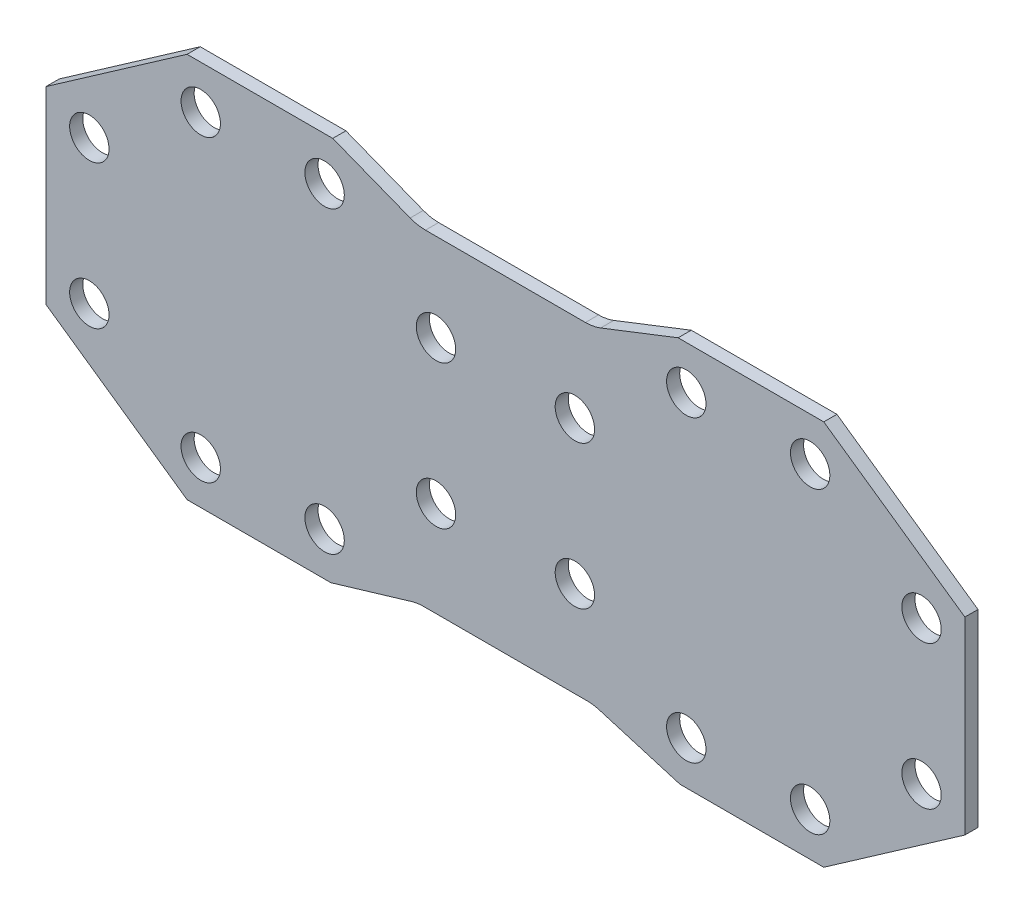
from build123d import *

# Parameters (mm, degrees)
MAIN_PLATE_DEPTH        = 31.75
CUT_EXTRUDE1_DEPTH      = 1762.00486901
CUT_EXTRUDE1_DEPTH_BACK = 1762.00486901
SKETCH5_R               = 47.625


with BuildPart() as part:
    # Sketch3 → Main Plate (new body)
    with BuildSketch(Plane(origin=(0, 0, 0), x_dir=(0, 1, 0), z_dir=(0, 0, 1))):
        with BuildLine():
            Line((466.324268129, 169.476784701), (466.324268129, -182.70492307))
            Line((466.324268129, -182.70492307), (228.234235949, -523.855268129))
            Line((228.234235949, -523.855268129), (-228.234235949, -523.855268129))
            Line((-228.234235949, -523.855268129), (-466.324268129, -182.70492307))
            Line((-466.324268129, -182.70492307), (-466.324268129, 165.037979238))
            Line((-466.324268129, 165.037979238), (-408.138164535, 360.294702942))
            ThreePointArc((-408.138164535, 360.294702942), (-404.970208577, 374.649076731), (-403.906803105, 389.310357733))
            Line((-403.906803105, 389.310357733), (-403.906803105, 784.677642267))
            ThreePointArc((-403.906803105, 784.677642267), (-404.970208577, 799.338923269), (-408.138164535, 813.693297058))
            Line((-408.138164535, 813.693297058), (-466.324268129, 1008.950020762))
            Line((-466.324268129, 1008.950020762), (-466.324268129, 1356.69292307))
            Line((-466.324268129, 1356.69292307), (-228.234235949, 1697.843268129))
            Line((-228.234235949, 1697.843268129), (228.234235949, 1697.843268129))
            Line((228.234235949, 1697.843268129), (466.324268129, 1356.69292307))
            Line((466.324268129, 1356.69292307), (466.324268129, 1004.511215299))
            Line((466.324268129, 1004.511215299), (393.274931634, 817.306570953))
            ThreePointArc((393.274931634, 817.306570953), (388.077053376, 799.164133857), (386.324268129, 780.37334606))
            Line((386.324268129, 780.37334606), (386.324268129, 393.61465394))
            ThreePointArc((386.324268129, 393.61465394), (388.077053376, 374.823866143), (393.274931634, 356.681429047))
            Line((393.274931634, 356.681429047), (466.324268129, 169.476784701))
        make_face()
    extrude(amount=MAIN_PLATE_DEPTH)

    # Sketch5 → Cut-Extrude1 (cut, two sides: drawn at the far end of the back side and taken through both)
    with BuildSketch(Plane(origin=(0, 0, 0), x_dir=(0, 1, 0), z_dir=(0, 0, 1)).offset(-CUT_EXTRUDE1_DEPTH_BACK)):
        with Locations(Location((-173.588730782, 419.080268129, 0), (0, 0, 270))):
            Circle(SKETCH5_R)
        with Locations(Location((173.588730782, 419.080268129, 0), (0, 0, 270))):
            Circle(SKETCH5_R)
        with Locations(Location((361.549268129, 149.758610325, 0), (0, 0, 270))):
            Circle(SKETCH5_R)
        with Locations(Location((361.549268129, -149.758610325, 0), (0, 0, 270))):
            Circle(SKETCH5_R)
        with Locations(Location((173.588730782, -419.080268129, 0), (0, 0, 270))):
            Circle(SKETCH5_R)
        with Locations(Location((-173.588730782, -419.080268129, 0), (0, 0, 270))):
            Circle(SKETCH5_R)
        with Locations(Location((-361.549268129, -149.758610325, 0), (0, 0, 270))):
            Circle(SKETCH5_R)
        with Locations(Location((-361.549268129, 149.758610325, 0), (0, 0, 270))):
            Circle(SKETCH5_R)
        with Locations(Location((-173.588730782, 1593.068268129, 0), (0, 0, 270))):
            Circle(SKETCH5_R)
        with Locations(Location((173.588730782, 1593.068268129, 0), (0, 0, 270))):
            Circle(SKETCH5_R)
        with Locations(Location((173.588730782, 754.907731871, 0), (0, 0, 270))):
            Circle(SKETCH5_R)
        with Locations(Location((361.549268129, 1323.746610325, 0), (0, 0, 270))):
            Circle(SKETCH5_R)
        with Locations(Location((-361.549268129, 1323.746610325, 0), (0, 0, 270))):
            Circle(SKETCH5_R)
        with Locations(Location((-173.588730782, 754.907731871, 0), (0, 0, 270))):
            Circle(SKETCH5_R)
        with Locations(Location((361.549268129, 1024.229389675, 0), (0, 0, 270))):
            Circle(SKETCH5_R)
        with Locations(Location((-361.549268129, 1024.229389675, 0), (0, 0, 270))):
            Circle(SKETCH5_R)
    extrude(amount=CUT_EXTRUDE1_DEPTH + CUT_EXTRUDE1_DEPTH_BACK, mode=Mode.SUBTRACT)


solid = part.part
